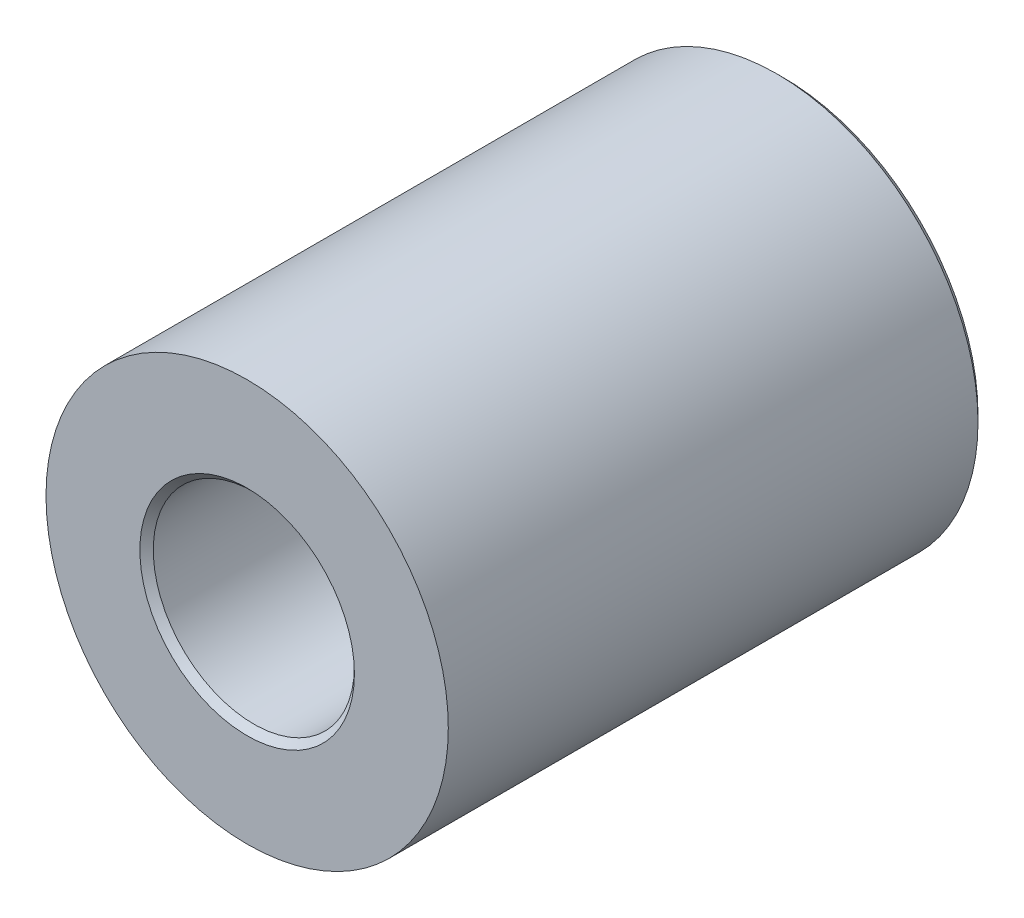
from build123d import *

# Parameters (mm, degrees)
ESQUISSE1_R      = 3
EXTRUSION2_DEPTH = 8
ESQUISSE2_R      = 1.5
EXTRUSION3_DEPTH = 10.055385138
CHANFREIN4_SIZE  = 0.1
CHANFREIN5_SIZE  = 0.1


with BuildPart() as part:
    # Esquisse1 → Extrusion2 (new body)
    with BuildSketch(Plane.XY):
        Circle(ESQUISSE1_R)
    extrude(amount=EXTRUSION2_DEPTH)

    # Esquisse2 → Extrusion3 (cut, through all)
    with BuildSketch(Plane.XY.offset(8)):
        Circle(ESQUISSE2_R)
    extrude(amount=-EXTRUSION3_DEPTH, mode=Mode.SUBTRACT)

    # Chanfrein4
    chanfrein4_edges = [part.edges().sort_by_distance(p)[0] for p in [
        (-3, 0, 0),
    ]]
    chamfer(chanfrein4_edges, length=CHANFREIN4_SIZE)

    # Chanfrein5
    chanfrein5_edges = [part.edges().sort_by_distance(p)[0] for p in [
        (-1.5, 0, 8),
    ]]
    chamfer(chanfrein5_edges, length=CHANFREIN5_SIZE)


solid = part.part
